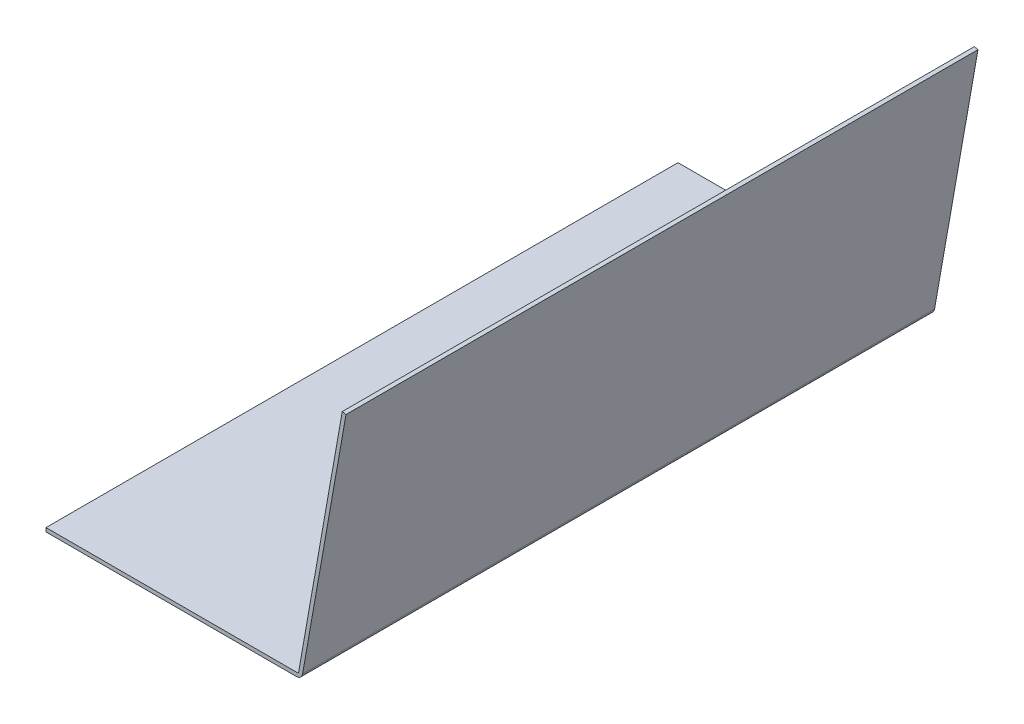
ISO-10303-21;
HEADER;
FILE_DESCRIPTION(('STEP AP214'),'2;1');
FILE_NAME('part.step','',(''),(''),'','','');
FILE_SCHEMA(('AUTOMOTIVE_DESIGN { 1 0 10303 214 1 1 1 1 }'));
ENDSEC;
DATA;
#1=APPLICATION_CONTEXT('core data for automotive mechanical design processes');
#2=APPLICATION_PROTOCOL_DEFINITION('international standard','automotive_design',2000,#1);
#3=PRODUCT_CONTEXT('',#1,'mechanical');
#4=PRODUCT('Part','Part','',(#3));
#5=PRODUCT_RELATED_PRODUCT_CATEGORY('part','',(#4));
#6=PRODUCT_DEFINITION_FORMATION('','',#4);
#7=PRODUCT_DEFINITION_CONTEXT('part definition',#1,'design');
#8=PRODUCT_DEFINITION('design','',#6,#7);
#9=PRODUCT_DEFINITION_SHAPE('','',#8);
#10=(LENGTH_UNIT() NAMED_UNIT(*) SI_UNIT(.MILLI.,.METRE.));
#11=(NAMED_UNIT(*) PLANE_ANGLE_UNIT() SI_UNIT($,.RADIAN.));
#12=(NAMED_UNIT(*) SI_UNIT($,.STERADIAN.) SOLID_ANGLE_UNIT());
#13=UNCERTAINTY_MEASURE_WITH_UNIT(LENGTH_MEASURE(1.E-05),#10,'distance_accuracy_value','');
#14=(GEOMETRIC_REPRESENTATION_CONTEXT(3) GLOBAL_UNCERTAINTY_ASSIGNED_CONTEXT((#13)) GLOBAL_UNIT_ASSIGNED_CONTEXT((#10,
#11,#12)) REPRESENTATION_CONTEXT('',''));
#15=CARTESIAN_POINT('',(0.,0.,0.));
#16=DIRECTION('',(0.,0.,1.));
#17=DIRECTION('',(1.,0.,0.));
#18=AXIS2_PLACEMENT_3D('',#15,#16,#17);
#19=CARTESIAN_POINT('',(135.051594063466,-0.520944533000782,497.));
#20=DIRECTION('',(-0.984807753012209,0.173648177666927,0.));
#21=DIRECTION('',(-0.173648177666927,-0.984807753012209,0.));
#22=AXIS2_PLACEMENT_3D('',#19,#20,#21);
#23=PLANE('',#22);
#24=DIRECTION('',(0.173648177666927,0.984807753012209,0.));
#25=VECTOR('',#24,1.);
#26=CARTESIAN_POINT('',(135.051594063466,-0.520944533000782,497.));
#27=LINE('',#26,#25);
#28=CARTESIAN_POINT('',(135.343010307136,1.13175911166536,497.));
#29=VERTEX_POINT('',#28);
#30=CARTESIAN_POINT('',(169.520757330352,194.963394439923,497.));
#31=VERTEX_POINT('',#30);
#32=EDGE_CURVE('E90',#29,#31,#27,.T.);
#33=ORIENTED_EDGE('',*,*,#32,.F.);
#34=DIRECTION('',(0.,0.,-1.));
#35=VECTOR('',#34,1.);
#36=CARTESIAN_POINT('',(135.343010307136,1.13175911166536,497.));
#37=LINE('',#36,#35);
#38=CARTESIAN_POINT('',(135.343010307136,1.13175911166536,0.));
#39=VERTEX_POINT('',#38);
#40=EDGE_CURVE('E109',#29,#39,#37,.T.);
#41=ORIENTED_EDGE('',*,*,#40,.T.);
#42=DIRECTION('',(0.173648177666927,0.984807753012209,0.));
#43=VECTOR('',#42,1.);
#44=CARTESIAN_POINT('',(135.051594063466,-0.520944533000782,0.));
#45=LINE('',#44,#43);
#46=CARTESIAN_POINT('',(169.520757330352,194.963394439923,0.));
#47=VERTEX_POINT('',#46);
#48=EDGE_CURVE('E105',#39,#47,#45,.T.);
#49=ORIENTED_EDGE('',*,*,#48,.T.);
#50=DIRECTION('',(0.,0.,-1.));
#51=VECTOR('',#50,1.);
#52=CARTESIAN_POINT('',(169.520757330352,194.963394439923,497.));
#53=LINE('',#52,#51);
#54=EDGE_CURVE('E104',#31,#47,#53,.T.);
#55=ORIENTED_EDGE('',*,*,#54,.F.);
#56=EDGE_LOOP('',(#33,#41,#49,#55));
#57=FACE_BOUND('',#56,.T.);
#58=ADVANCED_FACE('F31',(#57),#23,.F.);
#59=CARTESIAN_POINT('',(166.566334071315,195.484338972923,497.));
#60=DIRECTION('',(0.173648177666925,0.984807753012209,0.));
#61=DIRECTION('',(-0.984807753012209,0.173648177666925,0.));
#62=AXIS2_PLACEMENT_3D('',#59,#60,#61);
#63=PLANE('',#62);
#64=DIRECTION('',(0.984807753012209,-0.173648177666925,0.));
#65=VECTOR('',#64,1.);
#66=CARTESIAN_POINT('',(166.566334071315,195.484338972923,0.));
#67=LINE('',#66,#65);
#68=CARTESIAN_POINT('',(166.566334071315,195.484338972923,0.));
#69=VERTEX_POINT('',#68);
#70=EDGE_CURVE('E127',#69,#47,#67,.T.);
#71=ORIENTED_EDGE('',*,*,#70,.F.);
#72=DIRECTION('',(0.,0.,-1.));
#73=VECTOR('',#72,1.);
#74=CARTESIAN_POINT('',(166.566334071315,195.484338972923,497.));
#75=LINE('',#74,#73);
#76=CARTESIAN_POINT('',(166.566334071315,195.484338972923,497.));
#77=VERTEX_POINT('',#76);
#78=EDGE_CURVE('E110',#77,#69,#75,.T.);
#79=ORIENTED_EDGE('',*,*,#78,.F.);
#80=DIRECTION('',(0.984807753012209,-0.173648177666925,0.));
#81=VECTOR('',#80,1.);
#82=CARTESIAN_POINT('',(166.566334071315,195.484338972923,497.));
#83=LINE('',#82,#81);
#84=EDGE_CURVE('E95',#77,#31,#83,.T.);
#85=ORIENTED_EDGE('',*,*,#84,.T.);
#86=ORIENTED_EDGE('',*,*,#54,.T.);
#87=EDGE_LOOP('',(#71,#79,#85,#86));
#88=FACE_BOUND('',#87,.T.);
#89=ADVANCED_FACE('F112',(#88),#63,.T.);
#90=CARTESIAN_POINT('',(132.09717080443,0.,497.));
#91=DIRECTION('',(-0.984807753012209,0.173648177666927,0.));
#92=DIRECTION('',(-0.173648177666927,-0.984807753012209,0.));
#93=AXIS2_PLACEMENT_3D('',#90,#91,#92);
#94=PLANE('',#93);
#95=DIRECTION('',(0.173648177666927,0.984807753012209,0.));
#96=VECTOR('',#95,1.);
#97=CARTESIAN_POINT('',(132.09717080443,0.,0.));
#98=LINE('',#97,#96);
#99=CARTESIAN_POINT('',(132.09717080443,0.,0.));
#100=VERTEX_POINT('',#99);
#101=EDGE_CURVE('E129',#100,#69,#98,.T.);
#102=ORIENTED_EDGE('',*,*,#101,.F.);
#103=DIRECTION('',(0.,0.,-1.));
#104=VECTOR('',#103,1.);
#105=CARTESIAN_POINT('',(132.09717080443,0.,497.));
#106=LINE('',#105,#104);
#107=CARTESIAN_POINT('',(132.09717080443,0.,497.));
#108=VERTEX_POINT('',#107);
#109=EDGE_CURVE('E142',#108,#100,#106,.T.);
#110=ORIENTED_EDGE('',*,*,#109,.F.);
#111=DIRECTION('',(0.173648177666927,0.984807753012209,0.));
#112=VECTOR('',#111,1.);
#113=CARTESIAN_POINT('',(132.09717080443,0.,497.));
#114=LINE('',#113,#112);
#115=EDGE_CURVE('E113',#108,#77,#114,.T.);
#116=ORIENTED_EDGE('',*,*,#115,.T.);
#117=ORIENTED_EDGE('',*,*,#78,.T.);
#118=EDGE_LOOP('',(#102,#110,#116,#117));
#119=FACE_BOUND('',#118,.T.);
#120=ADVANCED_FACE('F151',(#119),#94,.T.);
#121=CARTESIAN_POINT('',(-66.4028291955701,0.,497.));
#122=DIRECTION('',(0.,1.,0.));
#123=DIRECTION('',(0.,0.,1.));
#124=AXIS2_PLACEMENT_3D('',#121,#122,#123);
#125=PLANE('',#124);
#126=DIRECTION('',(1.,0.,0.));
#127=VECTOR('',#126,1.);
#128=CARTESIAN_POINT('',(-66.4028291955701,0.,0.));
#129=LINE('',#128,#127);
#130=CARTESIAN_POINT('',(-66.4028291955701,0.,0.));
#131=VERTEX_POINT('',#130);
#132=EDGE_CURVE('E132',#131,#100,#129,.T.);
#133=ORIENTED_EDGE('',*,*,#132,.F.);
#134=DIRECTION('',(0.,0.,-1.));
#135=VECTOR('',#134,1.);
#136=CARTESIAN_POINT('',(-66.4028291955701,0.,497.));
#137=LINE('',#136,#135);
#138=CARTESIAN_POINT('',(-66.4028291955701,0.,497.));
#139=VERTEX_POINT('',#138);
#140=EDGE_CURVE('E140',#139,#131,#137,.T.);
#141=ORIENTED_EDGE('',*,*,#140,.F.);
#142=DIRECTION('',(1.,0.,0.));
#143=VECTOR('',#142,1.);
#144=CARTESIAN_POINT('',(-66.4028291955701,0.,497.));
#145=LINE('',#144,#143);
#146=EDGE_CURVE('E115',#139,#108,#145,.T.);
#147=ORIENTED_EDGE('',*,*,#146,.T.);
#148=ORIENTED_EDGE('',*,*,#109,.T.);
#149=EDGE_LOOP('',(#133,#141,#147,#148));
#150=FACE_BOUND('',#149,.T.);
#151=ADVANCED_FACE('F155',(#150),#125,.T.);
#152=CARTESIAN_POINT('',(-66.4028291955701,-3.,497.));
#153=DIRECTION('',(-1.,0.,0.));
#154=DIRECTION('',(0.,0.,1.));
#155=AXIS2_PLACEMENT_3D('',#152,#153,#154);
#156=PLANE('',#155);
#157=DIRECTION('',(0.,1.,0.));
#158=VECTOR('',#157,1.);
#159=CARTESIAN_POINT('',(-66.4028291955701,-3.,0.));
#160=LINE('',#159,#158);
#161=CARTESIAN_POINT('',(-66.4028291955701,-3.,0.));
#162=VERTEX_POINT('',#161);
#163=EDGE_CURVE('E135',#162,#131,#160,.T.);
#164=ORIENTED_EDGE('',*,*,#163,.F.);
#165=DIRECTION('',(0.,0.,-1.));
#166=VECTOR('',#165,1.);
#167=CARTESIAN_POINT('',(-66.4028291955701,-3.,497.));
#168=LINE('',#167,#166);
#169=CARTESIAN_POINT('',(-66.4028291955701,-3.,497.));
#170=VERTEX_POINT('',#169);
#171=EDGE_CURVE('E125',#170,#162,#168,.T.);
#172=ORIENTED_EDGE('',*,*,#171,.F.);
#173=DIRECTION('',(0.,1.,0.));
#174=VECTOR('',#173,1.);
#175=CARTESIAN_POINT('',(-66.4028291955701,-3.,497.));
#176=LINE('',#175,#174);
#177=EDGE_CURVE('E120',#170,#139,#176,.T.);
#178=ORIENTED_EDGE('',*,*,#177,.T.);
#179=ORIENTED_EDGE('',*,*,#140,.T.);
#180=EDGE_LOOP('',(#164,#172,#178,#179));
#181=FACE_BOUND('',#180,.T.);
#182=ADVANCED_FACE('F158',(#181),#156,.T.);
#183=CARTESIAN_POINT('',(-66.4028291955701,-3.,497.));
#184=DIRECTION('',(0.,1.,0.));
#185=DIRECTION('',(0.,0.,1.));
#186=AXIS2_PLACEMENT_3D('',#183,#184,#185);
#187=PLANE('',#186);
#188=DIRECTION('',(1.,0.,0.));
#189=VECTOR('',#188,1.);
#190=CARTESIAN_POINT('',(-66.4028291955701,-3.,0.));
#191=LINE('',#190,#189);
#192=CARTESIAN_POINT('',(130.418971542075,-3.,0.));
#193=VERTEX_POINT('',#192);
#194=EDGE_CURVE('E101',#162,#193,#191,.T.);
#195=ORIENTED_EDGE('',*,*,#194,.T.);
#196=DIRECTION('',(0.,0.,-1.));
#197=VECTOR('',#196,1.);
#198=CARTESIAN_POINT('',(130.418971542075,-3.,497.));
#199=LINE('',#198,#197);
#200=CARTESIAN_POINT('',(130.418971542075,-3.,497.));
#201=VERTEX_POINT('',#200);
#202=EDGE_CURVE('E39',#193,#201,#199,.F.);
#203=ORIENTED_EDGE('',*,*,#202,.T.);
#204=DIRECTION('',(1.,0.,0.));
#205=VECTOR('',#204,1.);
#206=CARTESIAN_POINT('',(-66.4028291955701,-3.,497.));
#207=LINE('',#206,#205);
#208=EDGE_CURVE('E123',#170,#201,#207,.T.);
#209=ORIENTED_EDGE('',*,*,#208,.F.);
#210=ORIENTED_EDGE('',*,*,#171,.T.);
#211=EDGE_LOOP('',(#195,#203,#209,#210));
#212=FACE_BOUND('',#211,.T.);
#213=ADVANCED_FACE('F176',(#212),#187,.F.);
#214=CARTESIAN_POINT('',(169.520757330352,194.963394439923,497.));
#215=DIRECTION('',(0.,0.,-1.));
#216=DIRECTION('',(-1.,0.,0.));
#217=AXIS2_PLACEMENT_3D('',#214,#215,#216);
#218=PLANE('',#217);
#219=ORIENTED_EDGE('',*,*,#208,.T.);
#220=CARTESIAN_POINT('',(130.418971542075,2.,497.));
#221=DIRECTION('',(0.,0.,-1.));
#222=DIRECTION('',(-1.,0.,0.));
#223=AXIS2_PLACEMENT_3D('',#220,#221,#222);
#224=CIRCLE('',#223,5.);
#225=EDGE_CURVE('E11',#201,#29,#224,.F.);
#226=ORIENTED_EDGE('',*,*,#225,.T.);
#227=ORIENTED_EDGE('',*,*,#32,.T.);
#228=ORIENTED_EDGE('',*,*,#84,.F.);
#229=ORIENTED_EDGE('',*,*,#115,.F.);
#230=ORIENTED_EDGE('',*,*,#146,.F.);
#231=ORIENTED_EDGE('',*,*,#177,.F.);
#232=EDGE_LOOP('',(#219,#226,#227,#228,#229,#230,#231));
#233=FACE_BOUND('',#232,.T.);
#234=ADVANCED_FACE('F92',(#233),#218,.F.);
#235=CARTESIAN_POINT('',(169.520757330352,194.963394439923,0.));
#236=DIRECTION('',(0.,0.,-1.));
#237=DIRECTION('',(-1.,0.,0.));
#238=AXIS2_PLACEMENT_3D('',#235,#236,#237);
#239=PLANE('',#238);
#240=ORIENTED_EDGE('',*,*,#48,.F.);
#241=CARTESIAN_POINT('',(130.418971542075,2.,0.));
#242=DIRECTION('',(0.,0.,-1.));
#243=DIRECTION('',(-1.,0.,0.));
#244=AXIS2_PLACEMENT_3D('',#241,#242,#243);
#245=CIRCLE('',#244,5.);
#246=EDGE_CURVE('E53',#39,#193,#245,.T.);
#247=ORIENTED_EDGE('',*,*,#246,.T.);
#248=ORIENTED_EDGE('',*,*,#194,.F.);
#249=ORIENTED_EDGE('',*,*,#163,.T.);
#250=ORIENTED_EDGE('',*,*,#132,.T.);
#251=ORIENTED_EDGE('',*,*,#101,.T.);
#252=ORIENTED_EDGE('',*,*,#70,.T.);
#253=EDGE_LOOP('',(#240,#247,#248,#249,#250,#251,#252));
#254=FACE_BOUND('',#253,.T.);
#255=ADVANCED_FACE('F147',(#254),#239,.T.);
#256=CARTESIAN_POINT('',(130.418971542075,2.,497.));
#257=DIRECTION('',(0.,0.,-1.));
#258=DIRECTION('',(-1.,0.,0.));
#259=AXIS2_PLACEMENT_3D('',#256,#257,#258);
#260=CYLINDRICAL_SURFACE('',#259,5.);
#261=ORIENTED_EDGE('',*,*,#225,.F.);
#262=ORIENTED_EDGE('',*,*,#202,.F.);
#263=ORIENTED_EDGE('',*,*,#246,.F.);
#264=ORIENTED_EDGE('',*,*,#40,.F.);
#265=EDGE_LOOP('',(#261,#262,#263,#264));
#266=FACE_BOUND('',#265,.T.);
#267=ADVANCED_FACE('F33',(#266),#260,.T.);
#268=CLOSED_SHELL('',(#58,#89,#120,#151,#182,#213,#234,#255,#267));
#269=MANIFOLD_SOLID_BREP('B2',#268);
#270=ADVANCED_BREP_SHAPE_REPRESENTATION('',(#18,#269),#14);
#271=SHAPE_DEFINITION_REPRESENTATION(#9,#270);
ENDSEC;
END-ISO-10303-21;
